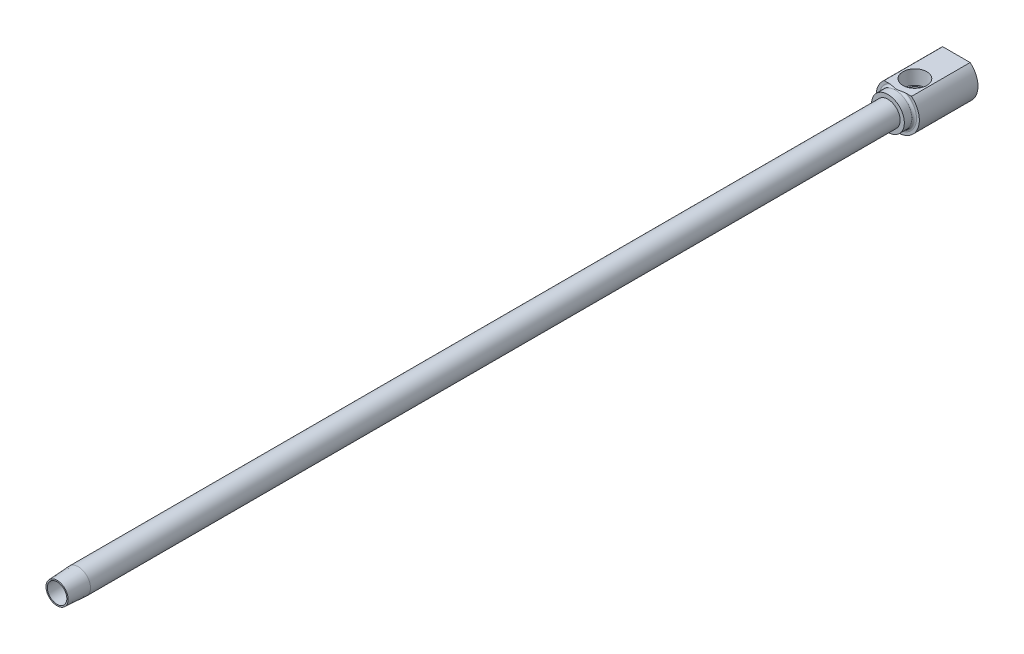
ISO-10303-21;
HEADER;
FILE_DESCRIPTION(('STEP AP214'),'2;1');
FILE_NAME('part.step','',(''),(''),'','','');
FILE_SCHEMA(('AUTOMOTIVE_DESIGN { 1 0 10303 214 1 1 1 1 }'));
ENDSEC;
DATA;
#1=APPLICATION_CONTEXT('core data for automotive mechanical design processes');
#2=APPLICATION_PROTOCOL_DEFINITION('international standard','automotive_design',2000,#1);
#3=PRODUCT_CONTEXT('',#1,'mechanical');
#4=PRODUCT('Part','Part','',(#3));
#5=PRODUCT_RELATED_PRODUCT_CATEGORY('part','',(#4));
#6=PRODUCT_DEFINITION_FORMATION('','',#4);
#7=PRODUCT_DEFINITION_CONTEXT('part definition',#1,'design');
#8=PRODUCT_DEFINITION('design','',#6,#7);
#9=PRODUCT_DEFINITION_SHAPE('','',#8);
#10=(LENGTH_UNIT() NAMED_UNIT(*) SI_UNIT(.MILLI.,.METRE.));
#11=(NAMED_UNIT(*) PLANE_ANGLE_UNIT() SI_UNIT($,.RADIAN.));
#12=(NAMED_UNIT(*) SI_UNIT($,.STERADIAN.) SOLID_ANGLE_UNIT());
#13=UNCERTAINTY_MEASURE_WITH_UNIT(LENGTH_MEASURE(1.E-05),#10,'distance_accuracy_value','');
#14=(GEOMETRIC_REPRESENTATION_CONTEXT(3) GLOBAL_UNCERTAINTY_ASSIGNED_CONTEXT((#13)) GLOBAL_UNIT_ASSIGNED_CONTEXT((#10,
#11,#12)) REPRESENTATION_CONTEXT('',''));
#15=CARTESIAN_POINT('',(0.,0.,0.));
#16=DIRECTION('',(0.,0.,1.));
#17=DIRECTION('',(1.,0.,0.));
#18=AXIS2_PLACEMENT_3D('',#15,#16,#17);
#19=CARTESIAN_POINT('',(0.,0.,-337.934766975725));
#20=DIRECTION('',(0.,0.,-1.));
#21=DIRECTION('',(-1.,0.,0.));
#22=AXIS2_PLACEMENT_3D('',#19,#20,#21);
#23=CYLINDRICAL_SURFACE('',#22,3.9751);
#24=CARTESIAN_POINT('',(0.,0.,-6.8834));
#25=DIRECTION('',(0.,0.,-1.));
#26=DIRECTION('',(-1.,0.,0.));
#27=AXIS2_PLACEMENT_3D('',#24,#25,#26);
#28=CIRCLE('',#27,3.9751);
#29=CARTESIAN_POINT('',(-3.9751,0.,-6.8834));
#30=VERTEX_POINT('',#29);
#31=EDGE_CURVE('E230',#30,#30,#28,.T.);
#32=ORIENTED_EDGE('',*,*,#31,.T.);
#33=EDGE_LOOP('',(#32));
#34=FACE_BOUND('',#33,.T.);
#35=CARTESIAN_POINT('',(0.,0.,-269.8496));
#36=DIRECTION('',(0.,0.,-1.));
#37=DIRECTION('',(-1.,0.,0.));
#38=AXIS2_PLACEMENT_3D('',#35,#36,#37);
#39=CIRCLE('',#38,3.9751);
#40=CARTESIAN_POINT('',(-3.9751,0.,-269.8496));
#41=VERTEX_POINT('',#40);
#42=EDGE_CURVE('E190',#41,#41,#39,.T.);
#43=ORIENTED_EDGE('',*,*,#42,.F.);
#44=EDGE_LOOP('',(#43));
#45=FACE_BOUND('',#44,.T.);
#46=ADVANCED_FACE('F15',(#34,#45),#23,.T.);
#47=CARTESIAN_POINT('',(-3.175,0.,-269.8496));
#48=DIRECTION('',(0.,0.,1.));
#49=DIRECTION('',(1.,0.,0.));
#50=AXIS2_PLACEMENT_3D('',#47,#48,#49);
#51=PLANE('',#50);
#52=CARTESIAN_POINT('',(0.,0.,-269.8496));
#53=DIRECTION('',(0.,0.,-1.));
#54=DIRECTION('',(-1.,0.,0.));
#55=AXIS2_PLACEMENT_3D('',#52,#53,#54);
#56=CIRCLE('',#55,3.175);
#57=CARTESIAN_POINT('',(-3.175,0.,-269.8496));
#58=VERTEX_POINT('',#57);
#59=EDGE_CURVE('E234',#58,#58,#56,.T.);
#60=ORIENTED_EDGE('',*,*,#59,.F.);
#61=EDGE_LOOP('',(#60));
#62=FACE_BOUND('',#61,.T.);
#63=CARTESIAN_POINT('',(0.,-0.206790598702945,-269.8496));
#64=DIRECTION('',(0.,0.,1.));
#65=DIRECTION('',(0.,1.,0.));
#66=AXIS2_PLACEMENT_3D('',#63,#64,#65);
#67=ELLIPSE('',#66,2.91070678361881,2.77750646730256);
#68=CARTESIAN_POINT('',(0.,2.70391618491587,-269.8496));
#69=VERTEX_POINT('',#68);
#70=EDGE_CURVE('E192',#69,#69,#67,.F.);
#71=ORIENTED_EDGE('',*,*,#70,.T.);
#72=EDGE_LOOP('',(#71));
#73=FACE_BOUND('',#72,.T.);
#74=ADVANCED_FACE('F211',(#62,#73),#51,.T.);
#75=CARTESIAN_POINT('',(-3.9751,0.,-269.8496));
#76=DIRECTION('',(0.,0.,1.));
#77=DIRECTION('',(1.,0.,0.));
#78=AXIS2_PLACEMENT_3D('',#75,#76,#77);
#79=PLANE('',#78);
#80=ORIENTED_EDGE('',*,*,#42,.T.);
#81=EDGE_LOOP('',(#80));
#82=FACE_BOUND('',#81,.T.);
#83=CARTESIAN_POINT('',(0.,0.,-269.8496));
#84=DIRECTION('',(0.,0.,-1.));
#85=DIRECTION('',(-1.,0.,0.));
#86=AXIS2_PLACEMENT_3D('',#83,#84,#85);
#87=CIRCLE('',#86,5.334);
#88=CARTESIAN_POINT('',(-5.334,0.,-269.8496));
#89=VERTEX_POINT('',#88);
#90=EDGE_CURVE('E252',#89,#89,#87,.T.);
#91=ORIENTED_EDGE('',*,*,#90,.F.);
#92=EDGE_LOOP('',(#91));
#93=FACE_BOUND('',#92,.T.);
#94=ADVANCED_FACE('F214',(#82,#93),#79,.T.);
#95=CARTESIAN_POINT('',(-3.175,0.,0.));
#96=DIRECTION('',(0.,0.,1.));
#97=DIRECTION('',(1.,0.,0.));
#98=AXIS2_PLACEMENT_3D('',#95,#96,#97);
#99=PLANE('',#98);
#100=CARTESIAN_POINT('',(0.,0.,0.));
#101=DIRECTION('',(0.,0.,-1.));
#102=DIRECTION('',(-1.,0.,0.));
#103=AXIS2_PLACEMENT_3D('',#100,#101,#102);
#104=CIRCLE('',#103,3.5941);
#105=CARTESIAN_POINT('',(-3.5941,0.,0.));
#106=VERTEX_POINT('',#105);
#107=EDGE_CURVE('E508',#106,#106,#104,.T.);
#108=ORIENTED_EDGE('',*,*,#107,.F.);
#109=EDGE_LOOP('',(#108));
#110=FACE_BOUND('',#109,.T.);
#111=CARTESIAN_POINT('',(0.,0.,0.));
#112=DIRECTION('',(0.,0.,-1.));
#113=DIRECTION('',(-1.,0.,0.));
#114=AXIS2_PLACEMENT_3D('',#111,#112,#113);
#115=CIRCLE('',#114,3.175);
#116=CARTESIAN_POINT('',(-3.175,0.,0.));
#117=VERTEX_POINT('',#116);
#118=EDGE_CURVE('E19',#117,#117,#115,.T.);
#119=ORIENTED_EDGE('',*,*,#118,.T.);
#120=EDGE_LOOP('',(#119));
#121=FACE_BOUND('',#120,.T.);
#122=ADVANCED_FACE('F17',(#110,#121),#99,.T.);
#123=CARTESIAN_POINT('',(0.,0.,-337.934766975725));
#124=DIRECTION('',(0.,0.,-1.));
#125=DIRECTION('',(-1.,0.,0.));
#126=AXIS2_PLACEMENT_3D('',#123,#124,#125);
#127=CYLINDRICAL_SURFACE('',#126,3.175);
#128=ORIENTED_EDGE('',*,*,#59,.T.);
#129=EDGE_LOOP('',(#128));
#130=FACE_BOUND('',#129,.T.);
#131=ORIENTED_EDGE('',*,*,#118,.F.);
#132=EDGE_LOOP('',(#131));
#133=FACE_BOUND('',#132,.T.);
#134=ADVANCED_FACE('F209',(#130,#133),#127,.F.);
#135=CARTESIAN_POINT('',(-7.0104,0.,-292.1));
#136=DIRECTION('',(0.,0.,-1.));
#137=DIRECTION('',(-1.,0.,0.));
#138=AXIS2_PLACEMENT_3D('',#135,#136,#137);
#139=PLANE('',#138);
#140=DIRECTION('',(1.,0.,0.));
#141=VECTOR('',#140,1.);
#142=CARTESIAN_POINT('',(-1.83308710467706,3.175,-292.1));
#143=LINE('',#142,#141);
#144=CARTESIAN_POINT('',(-1.83308710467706,3.175,-292.1));
#145=VERTEX_POINT('',#144);
#146=CARTESIAN_POINT('',(1.83308710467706,3.175,-292.1));
#147=VERTEX_POINT('',#146);
#148=EDGE_CURVE('E37',#145,#147,#143,.T.);
#149=ORIENTED_EDGE('',*,*,#148,.F.);
#150=DIRECTION('',(0.5,0.866025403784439,0.));
#151=VECTOR('',#150,1.);
#152=CARTESIAN_POINT('',(-3.66617420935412,0.,-292.1));
#153=LINE('',#152,#151);
#154=CARTESIAN_POINT('',(-3.66617420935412,0.,-292.1));
#155=VERTEX_POINT('',#154);
#156=EDGE_CURVE('E278',#155,#145,#153,.T.);
#157=ORIENTED_EDGE('',*,*,#156,.F.);
#158=DIRECTION('',(-0.5,0.866025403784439,0.));
#159=VECTOR('',#158,1.);
#160=CARTESIAN_POINT('',(-1.83308710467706,-3.175,-292.1));
#161=LINE('',#160,#159);
#162=CARTESIAN_POINT('',(-1.83308710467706,-3.175,-292.1));
#163=VERTEX_POINT('',#162);
#164=EDGE_CURVE('E282',#163,#155,#161,.T.);
#165=ORIENTED_EDGE('',*,*,#164,.F.);
#166=DIRECTION('',(-1.,0.,0.));
#167=VECTOR('',#166,1.);
#168=CARTESIAN_POINT('',(1.83308710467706,-3.175,-292.1));
#169=LINE('',#168,#167);
#170=CARTESIAN_POINT('',(1.83308710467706,-3.175,-292.1));
#171=VERTEX_POINT('',#170);
#172=EDGE_CURVE('E285',#171,#163,#169,.T.);
#173=ORIENTED_EDGE('',*,*,#172,.F.);
#174=DIRECTION('',(-0.5,-0.866025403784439,0.));
#175=VECTOR('',#174,1.);
#176=CARTESIAN_POINT('',(3.66617420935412,0.,-292.1));
#177=LINE('',#176,#175);
#178=CARTESIAN_POINT('',(3.66617420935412,0.,-292.1));
#179=VERTEX_POINT('',#178);
#180=EDGE_CURVE('E288',#179,#171,#177,.T.);
#181=ORIENTED_EDGE('',*,*,#180,.F.);
#182=DIRECTION('',(0.5,-0.866025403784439,0.));
#183=VECTOR('',#182,1.);
#184=CARTESIAN_POINT('',(1.83308710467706,3.175,-292.1));
#185=LINE('',#184,#183);
#186=EDGE_CURVE('E291',#147,#179,#185,.T.);
#187=ORIENTED_EDGE('',*,*,#186,.F.);
#188=EDGE_LOOP('',(#149,#157,#165,#173,#181,#187));
#189=FACE_BOUND('',#188,.T.);
#190=DIRECTION('',(-1.,0.,0.));
#191=VECTOR('',#190,1.);
#192=CARTESIAN_POINT('',(-4.4577,5.41060244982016,-292.1));
#193=LINE('',#192,#191);
#194=CARTESIAN_POINT('',(4.4577,5.41060244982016,-292.1));
#195=VERTEX_POINT('',#194);
#196=CARTESIAN_POINT('',(-4.4577,5.41060244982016,-292.1));
#197=VERTEX_POINT('',#196);
#198=EDGE_CURVE('E261',#195,#197,#193,.T.);
#199=ORIENTED_EDGE('',*,*,#198,.F.);
#200=CARTESIAN_POINT('',(0.,0.,-292.1));
#201=DIRECTION('',(0.,0.,-1.));
#202=DIRECTION('',(-1.,0.,0.));
#203=AXIS2_PLACEMENT_3D('',#200,#201,#202);
#204=CIRCLE('',#203,7.0104);
#205=EDGE_CURVE('E238',#195,#197,#204,.T.);
#206=ORIENTED_EDGE('',*,*,#205,.T.);
#207=EDGE_LOOP('',(#199,#206));
#208=FACE_BOUND('',#207,.T.);
#209=ADVANCED_FACE('F205',(#189,#208),#139,.T.);
#210=CARTESIAN_POINT('',(0.,0.,-337.934766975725));
#211=DIRECTION('',(0.,0.,-1.));
#212=DIRECTION('',(-1.,0.,0.));
#213=AXIS2_PLACEMENT_3D('',#210,#211,#212);
#214=CYLINDRICAL_SURFACE('',#213,7.0104);
#215=DIRECTION('',(0.,0.,-1.));
#216=VECTOR('',#215,1.);
#217=CARTESIAN_POINT('',(-4.4577,5.41060244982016,-262.7376));
#218=LINE('',#217,#216);
#219=CARTESIAN_POINT('',(-4.4577,5.41060244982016,-273.05));
#220=VERTEX_POINT('',#219);
#221=EDGE_CURVE('E258',#220,#197,#218,.T.);
#222=ORIENTED_EDGE('',*,*,#221,.T.);
#223=ORIENTED_EDGE('',*,*,#205,.F.);
#224=DIRECTION('',(0.,0.,-1.));
#225=VECTOR('',#224,1.);
#226=CARTESIAN_POINT('',(4.4577,5.41060244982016,-262.7376));
#227=LINE('',#226,#225);
#228=CARTESIAN_POINT('',(4.4577,5.41060244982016,-273.05));
#229=VERTEX_POINT('',#228);
#230=EDGE_CURVE('E259',#229,#195,#227,.T.);
#231=ORIENTED_EDGE('',*,*,#230,.F.);
#232=CARTESIAN_POINT('',(0.,0.,-273.05));
#233=DIRECTION('',(0.,0.,-1.));
#234=DIRECTION('',(-1.,0.,0.));
#235=AXIS2_PLACEMENT_3D('',#232,#233,#234);
#236=CIRCLE('',#235,7.0104);
#237=EDGE_CURVE('E241',#229,#220,#236,.T.);
#238=ORIENTED_EDGE('',*,*,#237,.T.);
#239=EDGE_LOOP('',(#222,#223,#231,#238));
#240=FACE_BOUND('',#239,.T.);
#241=ADVANCED_FACE('F201',(#240),#214,.T.);
#242=CARTESIAN_POINT('',(-6.096,0.,-273.05));
#243=DIRECTION('',(0.,0.,1.));
#244=DIRECTION('',(1.,0.,0.));
#245=AXIS2_PLACEMENT_3D('',#242,#243,#244);
#246=PLANE('',#245);
#247=DIRECTION('',(1.,0.,0.));
#248=VECTOR('',#247,1.);
#249=CARTESIAN_POINT('',(-6.096,5.41060244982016,-273.05));
#250=LINE('',#249,#248);
#251=CARTESIAN_POINT('',(-2.80830858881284,5.41060244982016,-273.05));
#252=VERTEX_POINT('',#251);
#253=EDGE_CURVE('E255',#220,#252,#250,.T.);
#254=ORIENTED_EDGE('',*,*,#253,.F.);
#255=ORIENTED_EDGE('',*,*,#237,.F.);
#256=CARTESIAN_POINT('',(2.80830858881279,5.41060244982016,-273.05));
#257=VERTEX_POINT('',#256);
#258=EDGE_CURVE('E256',#257,#229,#250,.T.);
#259=ORIENTED_EDGE('',*,*,#258,.F.);
#260=CARTESIAN_POINT('',(0.,0.,-273.05));
#261=DIRECTION('',(0.,0.,-1.));
#262=DIRECTION('',(-1.,0.,0.));
#263=AXIS2_PLACEMENT_3D('',#260,#261,#262);
#264=CIRCLE('',#263,6.096);
#265=EDGE_CURVE('E246',#257,#252,#264,.T.);
#266=ORIENTED_EDGE('',*,*,#265,.T.);
#267=EDGE_LOOP('',(#254,#255,#259,#266));
#268=FACE_BOUND('',#267,.T.);
#269=ADVANCED_FACE('F197',(#268),#246,.T.);
#270=CARTESIAN_POINT('',(0.,0.,-272.288));
#271=DIRECTION('',(0.,0.,-1.));
#272=DIRECTION('',(-1.,0.,0.));
#273=AXIS2_PLACEMENT_3D('',#270,#271,#272);
#274=TOROIDAL_SURFACE('',#273,6.096,0.762);
#275=CARTESIAN_POINT('',(0.,5.41060244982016,-272.620977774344));
#276=CARTESIAN_POINT('',(0.0521470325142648,5.41060244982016,-272.620966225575));
#277=CARTESIAN_POINT('',(0.104287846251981,5.41060244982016,-272.622542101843));
#278=CARTESIAN_POINT('',(0.208401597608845,5.41060244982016,-272.628631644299));
#279=CARTESIAN_POINT('',(0.26037450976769,5.41060244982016,-272.633145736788));
#280=CARTESIAN_POINT('',(0.41624150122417,5.41060244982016,-272.650448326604));
#281=CARTESIAN_POINT('',(0.519704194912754,5.41060244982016,-272.666991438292));
#282=CARTESIAN_POINT('',(0.7269184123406,5.41060244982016,-272.705619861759));
#283=CARTESIAN_POINT('',(0.830655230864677,5.41060244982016,-272.727776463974));
#284=CARTESIAN_POINT('',(1.03759009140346,5.41060244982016,-272.773840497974));
#285=CARTESIAN_POINT('',(1.14078865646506,5.41060244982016,-272.797745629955));
#286=CARTESIAN_POINT('',(1.34834228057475,5.41060244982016,-272.845205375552));
#287=CARTESIAN_POINT('',(1.45269869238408,5.41060244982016,-272.868754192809));
#288=CARTESIAN_POINT('',(1.66197970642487,5.41060244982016,-272.913460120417));
#289=CARTESIAN_POINT('',(1.76690452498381,5.41060244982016,-272.934616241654));
#290=CARTESIAN_POINT('',(1.97693672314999,5.41060244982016,-272.972852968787));
#291=CARTESIAN_POINT('',(2.08204009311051,5.41060244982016,-272.989954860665));
#292=CARTESIAN_POINT('',(2.29298648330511,5.41060244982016,-273.018645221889));
#293=CARTESIAN_POINT('',(2.39882937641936,5.41060244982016,-273.030234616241));
#294=CARTESIAN_POINT('',(2.63825679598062,5.41060244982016,-273.048170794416));
#295=CARTESIAN_POINT('',(2.77203238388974,5.41060244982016,-273.052426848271));
#296=CARTESIAN_POINT('',(2.97236053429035,5.41060244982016,-273.04675427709));
#297=CARTESIAN_POINT('',(3.03908464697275,5.41060244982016,-273.04285339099));
#298=CARTESIAN_POINT('',(3.17206397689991,5.41060244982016,-273.030250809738));
#299=CARTESIAN_POINT('',(3.23831943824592,5.41060244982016,-273.021551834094));
#300=CARTESIAN_POINT('',(3.37725624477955,5.41060244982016,-272.99711512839));
#301=CARTESIAN_POINT('',(3.44982215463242,5.41060244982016,-272.98069575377));
#302=CARTESIAN_POINT('',(3.59245961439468,5.41060244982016,-272.939071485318));
#303=CARTESIAN_POINT('',(3.66253326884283,5.41060244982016,-272.913874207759));
#304=CARTESIAN_POINT('',(3.77900159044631,5.41060244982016,-272.861023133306));
#305=CARTESIAN_POINT('',(3.82657256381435,5.41060244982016,-272.835989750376));
#306=CARTESIAN_POINT('',(3.91754959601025,5.41060244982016,-272.779184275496));
#307=CARTESIAN_POINT('',(3.96096325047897,5.41060244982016,-272.747424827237));
#308=CARTESIAN_POINT('',(4.02798010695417,5.41060244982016,-272.68789070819));
#309=CARTESIAN_POINT('',(4.05342428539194,5.41060244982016,-272.662198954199));
#310=CARTESIAN_POINT('',(4.10009948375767,5.41060244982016,-272.607215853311));
#311=CARTESIAN_POINT('',(4.12133630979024,5.41060244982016,-272.577929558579));
#312=CARTESIAN_POINT('',(4.15466127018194,5.41060244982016,-272.52188761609));
#313=CARTESIAN_POINT('',(4.1677217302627,5.41060244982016,-272.495714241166));
#314=CARTESIAN_POINT('',(4.18933719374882,5.41060244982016,-272.441556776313));
#315=CARTESIAN_POINT('',(4.19789541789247,5.41060244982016,-272.413573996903));
#316=CARTESIAN_POINT('',(4.20987180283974,5.41060244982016,-272.356334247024));
#317=CARTESIAN_POINT('',(4.21325884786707,5.41060244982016,-272.327070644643));
#318=CARTESIAN_POINT('',(4.21447858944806,5.41060244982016,-272.268428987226));
#319=CARTESIAN_POINT('',(4.2123124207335,5.41060244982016,-272.239050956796));
#320=CARTESIAN_POINT('',(4.20309810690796,5.41060244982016,-272.183964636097));
#321=CARTESIAN_POINT('',(4.19653350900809,5.41060244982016,-272.158172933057));
#322=CARTESIAN_POINT('',(4.17948851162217,5.41060244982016,-272.107930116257));
#323=CARTESIAN_POINT('',(4.16900680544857,5.41060244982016,-272.083479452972));
#324=CARTESIAN_POINT('',(4.14035818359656,5.41060244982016,-272.027852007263));
#325=CARTESIAN_POINT('',(4.12078333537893,5.41060244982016,-271.99740126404));
#326=CARTESIAN_POINT('',(4.07697861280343,5.41060244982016,-271.940060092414));
#327=CARTESIAN_POINT('',(4.05273917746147,5.41060244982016,-271.913177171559));
#328=CARTESIAN_POINT('',(3.9886872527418,5.41060244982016,-271.851156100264));
#329=CARTESIAN_POINT('',(3.94690497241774,5.41060244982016,-271.818064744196));
#330=CARTESIAN_POINT('',(3.85879527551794,5.41060244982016,-271.758693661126));
#331=CARTESIAN_POINT('',(3.81245915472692,5.41060244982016,-271.732427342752));
#332=CARTESIAN_POINT('',(3.72452671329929,5.41060244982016,-271.689445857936));
#333=CARTESIAN_POINT('',(3.68333828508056,5.41060244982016,-271.671877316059));
#334=CARTESIAN_POINT('',(3.59958587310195,5.41060244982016,-271.640360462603));
#335=CARTESIAN_POINT('',(3.55702092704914,5.41060244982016,-271.626414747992));
#336=CARTESIAN_POINT('',(3.42786902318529,5.41060244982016,-271.589290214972));
#337=CARTESIAN_POINT('',(3.339912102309,5.41060244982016,-271.570863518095));
#338=CARTESIAN_POINT('',(3.16528158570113,5.41060244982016,-271.544240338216));
#339=CARTESIAN_POINT('',(3.07864723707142,5.41060244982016,-271.535756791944));
#340=CARTESIAN_POINT('',(2.90489485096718,5.41060244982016,-271.526131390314));
#341=CARTESIAN_POINT('',(2.8177763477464,5.41060244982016,-271.524998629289));
#342=CARTESIAN_POINT('',(2.64327811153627,5.41060244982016,-271.52865046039));
#343=CARTESIAN_POINT('',(2.55589913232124,5.41060244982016,-271.533463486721));
#344=CARTESIAN_POINT('',(2.38166962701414,5.41060244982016,-271.547864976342));
#345=CARTESIAN_POINT('',(2.29481855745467,5.41060244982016,-271.557447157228));
#346=CARTESIAN_POINT('',(2.01384766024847,5.41060244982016,-271.594670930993));
#347=CARTESIAN_POINT('',(1.82076533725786,5.41060244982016,-271.629945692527));
#348=CARTESIAN_POINT('',(1.53229430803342,5.41060244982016,-271.689884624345));
#349=CARTESIAN_POINT('',(1.43609183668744,5.41060244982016,-271.711096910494));
#350=CARTESIAN_POINT('',(1.24390982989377,5.41060244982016,-271.754534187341));
#351=CARTESIAN_POINT('',(1.14793028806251,5.41060244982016,-271.776759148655));
#352=CARTESIAN_POINT('',(0.957697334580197,5.41060244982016,-271.820093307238));
#353=CARTESIAN_POINT('',(0.863446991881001,5.41060244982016,-271.841215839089));
#354=CARTESIAN_POINT('',(0.674290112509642,5.41060244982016,-271.880544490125));
#355=CARTESIAN_POINT('',(0.57938341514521,5.41060244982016,-271.898749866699));
#356=CARTESIAN_POINT('',(0.389272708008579,5.41060244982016,-271.928753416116));
#357=CARTESIAN_POINT('',(0.294077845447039,5.41060244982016,-271.940603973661));
#358=CARTESIAN_POINT('',(0.15079180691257,5.41060244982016,-271.951139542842));
#359=CARTESIAN_POINT('',(0.102969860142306,5.41060244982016,-271.953445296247));
#360=CARTESIAN_POINT('',(0.00727423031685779,5.41060244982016,-271.9554444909));
#361=CARTESIAN_POINT('',(-0.0405994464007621,5.41060244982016,-271.955138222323));
#362=CARTESIAN_POINT('',(-0.13693423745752,5.41060244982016,-271.951917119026));
#363=CARTESIAN_POINT('',(-0.185394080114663,5.41060244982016,-271.948965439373));
#364=CARTESIAN_POINT('',(-0.282118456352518,5.41060244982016,-271.940689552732));
#365=CARTESIAN_POINT('',(-0.330382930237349,5.41060244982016,-271.935364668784));
#366=CARTESIAN_POINT('',(-0.475151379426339,5.41060244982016,-271.916449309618));
#367=CARTESIAN_POINT('',(-0.571263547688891,5.41060244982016,-271.899936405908));
#368=CARTESIAN_POINT('',(-0.76404790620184,5.41060244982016,-271.862565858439));
#369=CARTESIAN_POINT('',(-0.860707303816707,5.41060244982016,-271.841647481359));
#370=CARTESIAN_POINT('',(-1.05357295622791,5.41060244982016,-271.798459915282));
#371=CARTESIAN_POINT('',(-1.1497796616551,5.41060244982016,-271.776192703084));
#372=CARTESIAN_POINT('',(-1.36433899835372,5.41060244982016,-271.727144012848));
#373=CARTESIAN_POINT('',(-1.48272280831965,5.41060244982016,-271.700495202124));
#374=CARTESIAN_POINT('',(-1.72029970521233,5.41060244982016,-271.650573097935));
#375=CARTESIAN_POINT('',(-1.83949323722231,5.41060244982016,-271.627301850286));
#376=CARTESIAN_POINT('',(-2.07789765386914,5.41060244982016,-271.586591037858));
#377=CARTESIAN_POINT('',(-2.19710038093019,5.41060244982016,-271.569105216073));
#378=CARTESIAN_POINT('',(-2.43636519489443,5.41060244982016,-271.542063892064));
#379=CARTESIAN_POINT('',(-2.5564264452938,5.41060244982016,-271.532501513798));
#380=CARTESIAN_POINT('',(-2.76780194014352,5.41060244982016,-271.52516409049));
#381=CARTESIAN_POINT('',(-2.85902659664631,5.41060244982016,-271.525092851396));
#382=CARTESIAN_POINT('',(-3.04144991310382,5.41060244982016,-271.532751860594));
#383=CARTESIAN_POINT('',(-3.13264774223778,5.41060244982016,-271.540504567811));
#384=CARTESIAN_POINT('',(-3.31458996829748,5.41060244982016,-271.566086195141));
#385=CARTESIAN_POINT('',(-3.40532344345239,5.41060244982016,-271.584002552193));
#386=CARTESIAN_POINT('',(-3.53857286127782,5.41060244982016,-271.620698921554));
#387=CARTESIAN_POINT('',(-3.58245316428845,5.41060244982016,-271.634541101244));
#388=CARTESIAN_POINT('',(-3.66883050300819,5.41060244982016,-271.665985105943));
#389=CARTESIAN_POINT('',(-3.71132868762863,5.41060244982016,-271.683583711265));
#390=CARTESIAN_POINT('',(-3.79234387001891,5.41060244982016,-271.722178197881));
#391=CARTESIAN_POINT('',(-3.83095410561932,5.41060244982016,-271.742975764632));
#392=CARTESIAN_POINT('',(-3.90549335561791,5.41060244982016,-271.789081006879));
#393=CARTESIAN_POINT('',(-3.94141935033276,5.41060244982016,-271.814393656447));
#394=CARTESIAN_POINT('',(-4.00964525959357,5.41060244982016,-271.870392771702));
#395=CARTESIAN_POINT('',(-4.04189445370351,5.41060244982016,-271.901142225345));
#396=CARTESIAN_POINT('',(-4.10014383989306,5.41060244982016,-271.968084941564));
#397=CARTESIAN_POINT('',(-4.12616464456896,5.41060244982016,-272.004259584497));
#398=CARTESIAN_POINT('',(-4.16162371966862,5.41060244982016,-272.067760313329));
#399=CARTESIAN_POINT('',(-4.17366550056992,5.41060244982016,-272.093633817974));
#400=CARTESIAN_POINT('',(-4.19334521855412,5.41060244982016,-272.147014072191));
#401=CARTESIAN_POINT('',(-4.20098675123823,5.41060244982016,-272.174519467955));
#402=CARTESIAN_POINT('',(-4.21130602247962,5.41060244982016,-272.23060948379));
#403=CARTESIAN_POINT('',(-4.21395773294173,5.41060244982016,-272.259198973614));
#404=CARTESIAN_POINT('',(-4.21398264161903,5.41060244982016,-272.316380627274));
#405=CARTESIAN_POINT('',(-4.21135613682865,5.41060244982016,-272.34497279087));
#406=CARTESIAN_POINT('',(-4.2014381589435,5.41060244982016,-272.399159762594));
#407=CARTESIAN_POINT('',(-4.19450087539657,5.41060244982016,-272.424821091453));
#408=CARTESIAN_POINT('',(-4.17676949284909,5.41060244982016,-272.474761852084));
#409=CARTESIAN_POINT('',(-4.16597399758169,5.41060244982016,-272.499040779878));
#410=CARTESIAN_POINT('',(-4.13643456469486,5.41060244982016,-272.554664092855));
#411=CARTESIAN_POINT('',(-4.11622825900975,5.41060244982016,-272.58523117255));
#412=CARTESIAN_POINT('',(-4.07115731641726,5.41060244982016,-272.642709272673));
#413=CARTESIAN_POINT('',(-4.04628281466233,5.41060244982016,-272.669612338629));
#414=CARTESIAN_POINT('',(-3.98047143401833,5.41060244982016,-272.731796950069));
#415=CARTESIAN_POINT('',(-3.93753463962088,5.41060244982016,-272.764948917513));
#416=CARTESIAN_POINT('',(-3.84713170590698,5.41060244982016,-272.824276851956));
#417=CARTESIAN_POINT('',(-3.79965701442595,5.41060244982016,-272.850439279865));
#418=CARTESIAN_POINT('',(-3.70945527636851,5.41060244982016,-272.893219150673));
#419=CARTESIAN_POINT('',(-3.66712202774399,5.41060244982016,-272.910685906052));
#420=CARTESIAN_POINT('',(-3.5810935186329,5.41060244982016,-272.941903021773));
#421=CARTESIAN_POINT('',(-3.53739729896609,5.41060244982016,-272.955650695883));
#422=CARTESIAN_POINT('',(-3.40486938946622,5.41060244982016,-272.992069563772));
#423=CARTESIAN_POINT('',(-3.3146965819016,5.41060244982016,-273.009873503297));
#424=CARTESIAN_POINT('',(-3.13512177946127,5.41060244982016,-273.035172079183));
#425=CARTESIAN_POINT('',(-3.04574747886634,5.41060244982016,-273.042887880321));
#426=CARTESIAN_POINT('',(-2.86659161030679,5.41060244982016,-273.050757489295));
#427=CARTESIAN_POINT('',(-2.77680968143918,5.41060244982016,-273.050902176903));
#428=CARTESIAN_POINT('',(-2.5970702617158,5.41060244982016,-273.045129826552));
#429=CARTESIAN_POINT('',(-2.50711380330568,5.41060244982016,-273.039185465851));
#430=CARTESIAN_POINT('',(-2.32777785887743,5.41060244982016,-273.022449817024));
#431=CARTESIAN_POINT('',(-2.2383978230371,5.41060244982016,-273.011664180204));
#432=CARTESIAN_POINT('',(-1.96748151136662,5.41060244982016,-272.97309869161));
#433=CARTESIAN_POINT('',(-1.78682109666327,5.41060244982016,-272.93931320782));
#434=CARTESIAN_POINT('',(-1.51682052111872,5.41060244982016,-272.88271359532));
#435=CARTESIAN_POINT('',(-1.42679945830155,5.41060244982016,-272.86281263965));
#436=CARTESIAN_POINT('',(-1.24695389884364,5.41060244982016,-272.822143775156));
#437=CARTESIAN_POINT('',(-1.15712938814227,5.41060244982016,-272.801375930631));
#438=CARTESIAN_POINT('',(-0.979057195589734,5.41060244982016,-272.760739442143));
#439=CARTESIAN_POINT('',(-0.890811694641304,5.41060244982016,-272.740861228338));
#440=CARTESIAN_POINT('',(-0.713780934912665,5.41060244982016,-272.703401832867));
#441=CARTESIAN_POINT('',(-0.624995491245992,5.41060244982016,-272.685821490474));
#442=CARTESIAN_POINT('',(-0.447203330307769,5.41060244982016,-272.655660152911));
#443=CARTESIAN_POINT('',(-0.358203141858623,5.41060244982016,-272.643043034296));
#444=CARTESIAN_POINT('',(-0.179461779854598,5.41060244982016,-272.625716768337));
#445=CARTESIAN_POINT('',(-0.0897216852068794,5.41060244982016,-272.620997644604));
#446=CARTESIAN_POINT('',(0.,5.41060244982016,-272.620977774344));
#447=B_SPLINE_CURVE_WITH_KNOTS('',3,(#275,#276,#277,#278,#279,#280,#281,#282,#283,#284,#285,
#286,#287,#288,#289,#290,#291,#292,#293,#294,#295,#296,#297,#298,#299,#300,#301,#302,#303,#304,
#305,#306,#307,#308,#309,#310,#311,#312,#313,#314,#315,#316,#317,#318,#319,#320,#321,#322,#323,
#324,#325,#326,#327,#328,#329,#330,#331,#332,#333,#334,#335,#336,#337,#338,#339,#340,#341,#342,
#343,#344,#345,#346,#347,#348,#349,#350,#351,#352,#353,#354,#355,#356,#357,#358,#359,#360,#361,
#362,#363,#364,#365,#366,#367,#368,#369,#370,#371,#372,#373,#374,#375,#376,#377,#378,#379,#380,
#381,#382,#383,#384,#385,#386,#387,#388,#389,#390,#391,#392,#393,#394,#395,#396,#397,#398,#399,
#400,#401,#402,#403,#404,#405,#406,#407,#408,#409,#410,#411,#412,#413,#414,#415,#416,#417,#418,
#419,#420,#421,#422,#423,#424,#425,#426,#427,#428,#429,#430,#431,#432,#433,#434,#435,#436,#437,
#438,#439,#440,#441,#442,#443,#444,#445,#446),.UNSPECIFIED.,.T.,.F.,(4,2,2,2,2,2,2,2,2,2,2,2,2,
2,2,2,2,2,2,2,2,2,2,2,2,2,2,2,2,2,2,2,2,2,2,2,2,2,2,2,2,2,2,2,2,2,2,2,2,2,2,2,2,2,2,2,2,2,2,2,2,
2,2,2,2,2,2,2,2,2,2,2,2,2,2,2,2,2,2,2,2,2,2,2,2,4),(0.,0.156408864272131,0.312840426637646,
0.626836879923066,0.945040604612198,1.26283307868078,1.58376524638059,1.90482960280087,
2.22416896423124,2.54345472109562,2.9441659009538,3.14454518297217,3.3448110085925,
3.56760205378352,3.79020027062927,3.95104939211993,4.11159879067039,4.21974493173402,
4.32774077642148,4.41514397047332,4.50248455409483,4.59034863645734,4.67819476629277,
4.75769203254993,4.83721584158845,4.94521135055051,5.05343062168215,5.2124385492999,
5.37175654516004,5.50590155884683,5.64014246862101,5.90890810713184,6.16970670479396,
6.43082789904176,6.69320268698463,6.95523275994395,7.5434079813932,7.83896772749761,
8.13451890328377,8.42427298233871,8.71410070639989,9.00150106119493,9.14506775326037,
9.28861849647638,9.43420020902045,9.5798234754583,9.87216797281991,10.1688428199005,
10.4650929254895,10.8291174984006,11.193361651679,11.5546188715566,11.9155622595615,
12.1889721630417,12.4631691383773,12.7397615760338,12.8776619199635,13.0154445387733,
13.1467577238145,13.2782164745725,13.411312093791,13.5439609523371,13.6292456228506,
13.7144605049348,13.8001186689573,13.8857720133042,13.965178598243,14.0446139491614,
14.1539273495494,14.2634744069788,14.4253063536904,14.5874495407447,14.7246386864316,
14.8619266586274,15.1368206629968,15.4055810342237,15.6746651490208,15.9449620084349,
16.2149441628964,16.7658370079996,17.0424344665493,17.319011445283,17.5903768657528,
17.8618411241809,18.131291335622,18.4004009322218),.UNSPECIFIED.);
#448=EDGE_CURVE('E105',#252,#257,#447,.T.);
#449=ORIENTED_EDGE('',*,*,#448,.F.);
#450=ORIENTED_EDGE('',*,*,#265,.F.);
#451=EDGE_LOOP('',(#449,#450));
#452=FACE_BOUND('',#451,.T.);
#453=CARTESIAN_POINT('',(0.,0.,-272.288));
#454=DIRECTION('',(0.,0.,-1.));
#455=DIRECTION('',(-1.,0.,0.));
#456=AXIS2_PLACEMENT_3D('',#453,#454,#455);
#457=CIRCLE('',#456,5.334);
#458=CARTESIAN_POINT('',(-5.334,0.,-272.288));
#459=VERTEX_POINT('',#458);
#460=EDGE_CURVE('E249',#459,#459,#457,.T.);
#461=ORIENTED_EDGE('',*,*,#460,.T.);
#462=EDGE_LOOP('',(#461));
#463=FACE_BOUND('',#462,.T.);
#464=ADVANCED_FACE('F193',(#452,#463),#274,.F.);
#465=CARTESIAN_POINT('',(0.,0.,-337.934766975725));
#466=DIRECTION('',(0.,0.,-1.));
#467=DIRECTION('',(-1.,0.,0.));
#468=AXIS2_PLACEMENT_3D('',#465,#466,#467);
#469=CYLINDRICAL_SURFACE('',#468,5.334);
#470=ORIENTED_EDGE('',*,*,#90,.T.);
#471=EDGE_LOOP('',(#470));
#472=FACE_BOUND('',#471,.T.);
#473=ORIENTED_EDGE('',*,*,#460,.F.);
#474=EDGE_LOOP('',(#473));
#475=FACE_BOUND('',#474,.T.);
#476=ADVANCED_FACE('F183',(#472,#475),#469,.T.);
#477=CARTESIAN_POINT('',(-4.4577,5.41060244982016,-262.7376));
#478=DIRECTION('',(0.,-1.,0.));
#479=DIRECTION('',(0.,0.,-1.));
#480=AXIS2_PLACEMENT_3D('',#477,#478,#479);
#481=PLANE('',#480);
#482=CARTESIAN_POINT('',(0.,5.41060244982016,-278.6126));
#483=DIRECTION('',(0.,-1.,0.));
#484=DIRECTION('',(0.,0.,-1.));
#485=AXIS2_PLACEMENT_3D('',#482,#483,#484);
#486=CIRCLE('',#485,3.8800785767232);
#487=CARTESIAN_POINT('',(0.,5.41060244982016,-282.492678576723));
#488=VERTEX_POINT('',#487);
#489=EDGE_CURVE('E510',#488,#488,#486,.T.);
#490=ORIENTED_EDGE('',*,*,#489,.T.);
#491=EDGE_LOOP('',(#490));
#492=FACE_BOUND('',#491,.T.);
#493=ORIENTED_EDGE('',*,*,#253,.T.);
#494=ORIENTED_EDGE('',*,*,#448,.T.);
#495=ORIENTED_EDGE('',*,*,#258,.T.);
#496=ORIENTED_EDGE('',*,*,#230,.T.);
#497=ORIENTED_EDGE('',*,*,#198,.T.);
#498=ORIENTED_EDGE('',*,*,#221,.F.);
#499=EDGE_LOOP('',(#493,#494,#495,#496,#497,#498));
#500=FACE_BOUND('',#499,.T.);
#501=ADVANCED_FACE('F179',(#492,#500),#481,.F.);
#502=CARTESIAN_POINT('',(-1.83308710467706,3.175,-287.274));
#503=DIRECTION('',(0.,1.,0.));
#504=DIRECTION('',(-1.,0.,0.));
#505=AXIS2_PLACEMENT_3D('',#502,#503,#504);
#506=PLANE('',#505);
#507=ORIENTED_EDGE('',*,*,#148,.T.);
#508=DIRECTION('',(0.,0.,-1.));
#509=VECTOR('',#508,1.);
#510=CARTESIAN_POINT('',(1.83308710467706,3.175,-287.274));
#511=LINE('',#510,#509);
#512=CARTESIAN_POINT('',(1.83308710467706,3.175,-287.274));
#513=VERTEX_POINT('',#512);
#514=EDGE_CURVE('E266',#513,#147,#511,.T.);
#515=ORIENTED_EDGE('',*,*,#514,.F.);
#516=DIRECTION('',(1.,0.,0.));
#517=VECTOR('',#516,1.);
#518=CARTESIAN_POINT('',(-1.83308710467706,3.175,-287.274));
#519=LINE('',#518,#517);
#520=CARTESIAN_POINT('',(-1.83308710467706,3.175,-287.274));
#521=VERTEX_POINT('',#520);
#522=EDGE_CURVE('E281',#521,#513,#519,.T.);
#523=ORIENTED_EDGE('',*,*,#522,.F.);
#524=DIRECTION('',(0.,0.,-1.));
#525=VECTOR('',#524,1.);
#526=CARTESIAN_POINT('',(-1.83308710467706,3.175,-287.274));
#527=LINE('',#526,#525);
#528=EDGE_CURVE('E265',#521,#145,#527,.T.);
#529=ORIENTED_EDGE('',*,*,#528,.T.);
#530=EDGE_LOOP('',(#507,#515,#523,#529));
#531=FACE_BOUND('',#530,.T.);
#532=ADVANCED_FACE('F161',(#531),#506,.F.);
#533=CARTESIAN_POINT('',(-3.66617420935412,0.,-287.274));
#534=DIRECTION('',(-0.866025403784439,0.5,0.));
#535=DIRECTION('',(-0.5,-0.866025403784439,0.));
#536=AXIS2_PLACEMENT_3D('',#533,#534,#535);
#537=PLANE('',#536);
#538=ORIENTED_EDGE('',*,*,#156,.T.);
#539=ORIENTED_EDGE('',*,*,#528,.F.);
#540=DIRECTION('',(0.5,0.866025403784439,0.));
#541=VECTOR('',#540,1.);
#542=CARTESIAN_POINT('',(-3.66617420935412,0.,-287.274));
#543=LINE('',#542,#541);
#544=CARTESIAN_POINT('',(-3.66617420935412,0.,-287.274));
#545=VERTEX_POINT('',#544);
#546=EDGE_CURVE('E269',#545,#521,#543,.T.);
#547=ORIENTED_EDGE('',*,*,#546,.F.);
#548=DIRECTION('',(0.,0.,-1.));
#549=VECTOR('',#548,1.);
#550=CARTESIAN_POINT('',(-3.66617420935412,0.,-287.274));
#551=LINE('',#550,#549);
#552=EDGE_CURVE('E275',#545,#155,#551,.T.);
#553=ORIENTED_EDGE('',*,*,#552,.T.);
#554=EDGE_LOOP('',(#538,#539,#547,#553));
#555=FACE_BOUND('',#554,.T.);
#556=ADVANCED_FACE('F157',(#555),#537,.F.);
#557=CARTESIAN_POINT('',(-1.83308710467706,-3.175,-287.274));
#558=DIRECTION('',(-0.866025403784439,-0.5,0.));
#559=DIRECTION('',(0.5,-0.866025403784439,0.));
#560=AXIS2_PLACEMENT_3D('',#557,#558,#559);
#561=PLANE('',#560);
#562=ORIENTED_EDGE('',*,*,#164,.T.);
#563=ORIENTED_EDGE('',*,*,#552,.F.);
#564=DIRECTION('',(-0.5,0.866025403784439,0.));
#565=VECTOR('',#564,1.);
#566=CARTESIAN_POINT('',(-1.83308710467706,-3.175,-287.274));
#567=LINE('',#566,#565);
#568=CARTESIAN_POINT('',(-1.83308710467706,-3.175,-287.274));
#569=VERTEX_POINT('',#568);
#570=EDGE_CURVE('E297',#569,#545,#567,.T.);
#571=ORIENTED_EDGE('',*,*,#570,.F.);
#572=DIRECTION('',(0.,0.,-1.));
#573=VECTOR('',#572,1.);
#574=CARTESIAN_POINT('',(-1.83308710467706,-3.175,-287.274));
#575=LINE('',#574,#573);
#576=EDGE_CURVE('E273',#569,#163,#575,.T.);
#577=ORIENTED_EDGE('',*,*,#576,.T.);
#578=EDGE_LOOP('',(#562,#563,#571,#577));
#579=FACE_BOUND('',#578,.T.);
#580=ADVANCED_FACE('F160',(#579),#561,.F.);
#581=CARTESIAN_POINT('',(1.83308710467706,-3.175,-287.274));
#582=DIRECTION('',(0.,-1.,0.));
#583=DIRECTION('',(1.,0.,0.));
#584=AXIS2_PLACEMENT_3D('',#581,#582,#583);
#585=PLANE('',#584);
#586=ORIENTED_EDGE('',*,*,#172,.T.);
#587=ORIENTED_EDGE('',*,*,#576,.F.);
#588=DIRECTION('',(-1.,0.,0.));
#589=VECTOR('',#588,1.);
#590=CARTESIAN_POINT('',(1.83308710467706,-3.175,-287.274));
#591=LINE('',#590,#589);
#592=CARTESIAN_POINT('',(1.83308710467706,-3.175,-287.274));
#593=VERTEX_POINT('',#592);
#594=EDGE_CURVE('E300',#593,#569,#591,.T.);
#595=ORIENTED_EDGE('',*,*,#594,.F.);
#596=DIRECTION('',(0.,0.,-1.));
#597=VECTOR('',#596,1.);
#598=CARTESIAN_POINT('',(1.83308710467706,-3.175,-287.274));
#599=LINE('',#598,#597);
#600=EDGE_CURVE('E271',#593,#171,#599,.T.);
#601=ORIENTED_EDGE('',*,*,#600,.T.);
#602=EDGE_LOOP('',(#586,#587,#595,#601));
#603=FACE_BOUND('',#602,.T.);
#604=ADVANCED_FACE('F165',(#603),#585,.F.);
#605=CARTESIAN_POINT('',(3.66617420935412,0.,-287.274));
#606=DIRECTION('',(0.866025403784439,-0.5,0.));
#607=DIRECTION('',(0.5,0.866025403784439,0.));
#608=AXIS2_PLACEMENT_3D('',#605,#606,#607);
#609=PLANE('',#608);
#610=ORIENTED_EDGE('',*,*,#180,.T.);
#611=ORIENTED_EDGE('',*,*,#600,.F.);
#612=DIRECTION('',(-0.5,-0.866025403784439,0.));
#613=VECTOR('',#612,1.);
#614=CARTESIAN_POINT('',(3.66617420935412,0.,-287.274));
#615=LINE('',#614,#613);
#616=CARTESIAN_POINT('',(3.66617420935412,0.,-287.274));
#617=VERTEX_POINT('',#616);
#618=EDGE_CURVE('E303',#617,#593,#615,.T.);
#619=ORIENTED_EDGE('',*,*,#618,.F.);
#620=DIRECTION('',(0.,0.,-1.));
#621=VECTOR('',#620,1.);
#622=CARTESIAN_POINT('',(3.66617420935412,0.,-287.274));
#623=LINE('',#622,#621);
#624=EDGE_CURVE('E268',#617,#179,#623,.T.);
#625=ORIENTED_EDGE('',*,*,#624,.T.);
#626=EDGE_LOOP('',(#610,#611,#619,#625));
#627=FACE_BOUND('',#626,.T.);
#628=ADVANCED_FACE('F169',(#627),#609,.F.);
#629=CARTESIAN_POINT('',(1.83308710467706,3.175,-287.274));
#630=DIRECTION('',(0.866025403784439,0.5,0.));
#631=DIRECTION('',(-0.5,0.866025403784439,0.));
#632=AXIS2_PLACEMENT_3D('',#629,#630,#631);
#633=PLANE('',#632);
#634=ORIENTED_EDGE('',*,*,#186,.T.);
#635=ORIENTED_EDGE('',*,*,#624,.F.);
#636=DIRECTION('',(0.5,-0.866025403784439,0.));
#637=VECTOR('',#636,1.);
#638=CARTESIAN_POINT('',(1.83308710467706,3.175,-287.274));
#639=LINE('',#638,#637);
#640=EDGE_CURVE('E306',#513,#617,#639,.T.);
#641=ORIENTED_EDGE('',*,*,#640,.F.);
#642=ORIENTED_EDGE('',*,*,#514,.T.);
#643=EDGE_LOOP('',(#634,#635,#641,#642));
#644=FACE_BOUND('',#643,.T.);
#645=ADVANCED_FACE('F155',(#644),#633,.F.);
#646=CARTESIAN_POINT('',(0.,0.,-287.274));
#647=DIRECTION('',(0.,0.,-1.));
#648=DIRECTION('',(-1.,0.,0.));
#649=AXIS2_PLACEMENT_3D('',#646,#647,#648);
#650=PLANE('',#649);
#651=ORIENTED_EDGE('',*,*,#522,.T.);
#652=ORIENTED_EDGE('',*,*,#640,.T.);
#653=ORIENTED_EDGE('',*,*,#618,.T.);
#654=ORIENTED_EDGE('',*,*,#594,.T.);
#655=ORIENTED_EDGE('',*,*,#570,.T.);
#656=ORIENTED_EDGE('',*,*,#546,.T.);
#657=EDGE_LOOP('',(#651,#652,#653,#654,#655,#656));
#658=FACE_BOUND('',#657,.T.);
#659=ADVANCED_FACE('F151',(#658),#650,.T.);
#660=CARTESIAN_POINT('',(0.,-2.98624109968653,-278.579055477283));
#661=DIRECTION('',(0.,0.298636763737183,0.954366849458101));
#662=DIRECTION('',(0.,-0.954366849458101,0.298636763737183));
#663=AXIS2_PLACEMENT_3D('',#660,#661,#662);
#664=CONICAL_SURFACE('',#663,2.29646041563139,0.826862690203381);
#665=CARTESIAN_POINT('',(-4.07250877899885,-2.19612830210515,-277.102011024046));
#666=CARTESIAN_POINT('',(-3.92894564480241,-2.29613709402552,-277.213288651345));
#667=CARTESIAN_POINT('',(-3.7849275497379,-2.39583064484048,-277.324277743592));
#668=CARTESIAN_POINT('',(-3.49542612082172,-2.59418522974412,-277.54539975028));
#669=CARTESIAN_POINT('',(-3.34994228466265,-2.69284588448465,-277.655532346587));
#670=CARTESIAN_POINT('',(-3.05718484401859,-2.88857438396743,-277.874485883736));
#671=CARTESIAN_POINT('',(-2.90991293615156,-2.98564356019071,-277.983307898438));
#672=CARTESIAN_POINT('',(-2.61260725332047,-3.17745365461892,-278.19919172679));
#673=CARTESIAN_POINT('',(-2.46257392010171,-3.27219493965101,-278.306253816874));
#674=CARTESIAN_POINT('',(-2.30585388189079,-3.36777676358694,-278.415215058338));
#675=CARTESIAN_POINT('',(-2.30125812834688,-3.37057671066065,-278.418407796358));
#676=CARTESIAN_POINT('',(-2.18325993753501,-3.44238980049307,-278.500317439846));
#677=CARTESIAN_POINT('',(-2.06866761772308,-3.51030800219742,-278.578312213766));
#678=CARTESIAN_POINT('',(-1.89428090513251,-3.6094992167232,-278.693860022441));
#679=CARTESIAN_POINT('',(-1.83573157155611,-3.64211739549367,-278.732137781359));
#680=CARTESIAN_POINT('',(-1.71764576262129,-3.70614874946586,-278.808162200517));
#681=CARTESIAN_POINT('',(-1.65810935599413,-3.73756200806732,-278.845908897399));
#682=CARTESIAN_POINT('',(-1.50902814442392,-3.81348555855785,-278.938797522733));
#683=CARTESIAN_POINT('',(-1.41877996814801,-3.85705520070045,-278.993603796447));
#684=CARTESIAN_POINT('',(-1.28105412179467,-3.91788385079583,-279.075307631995));
#685=CARTESIAN_POINT('',(-1.23473646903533,-3.93741186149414,-279.10246748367));
#686=CARTESIAN_POINT('',(-1.14132702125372,-3.97432114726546,-279.156903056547));
#687=CARTESIAN_POINT('',(-1.09423547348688,-3.99170309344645,-279.184178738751));
#688=CARTESIAN_POINT('',(-0.997307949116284,-4.02406270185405,-279.240699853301));
#689=CARTESIAN_POINT('',(-0.947443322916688,-4.03889834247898,-279.269978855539));
#690=CARTESIAN_POINT('',(-0.847763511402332,-4.06317338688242,-279.330895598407));
#691=CARTESIAN_POINT('',(-0.797948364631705,-4.07262087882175,-279.362529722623));
#692=CARTESIAN_POINT('',(-0.715255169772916,-4.08120879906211,-279.420969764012));
#693=CARTESIAN_POINT('',(-0.681720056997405,-4.08256924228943,-279.446442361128));
#694=CARTESIAN_POINT('',(-0.617985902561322,-4.0796552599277,-279.500845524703));
#695=CARTESIAN_POINT('',(-0.587772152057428,-4.075406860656,-279.529759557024));
#696=CARTESIAN_POINT('',(-0.532214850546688,-4.06142412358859,-279.590743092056));
#697=CARTESIAN_POINT('',(-0.506873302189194,-4.05168753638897,-279.622813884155));
#698=CARTESIAN_POINT('',(-0.460853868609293,-4.02824244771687,-279.688937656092));
#699=CARTESIAN_POINT('',(-0.440201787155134,-4.01451287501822,-279.723000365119));
#700=CARTESIAN_POINT('',(-0.402209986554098,-3.98452453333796,-279.792327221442));
#701=CARTESIAN_POINT('',(-0.384909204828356,-3.96823960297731,-279.827600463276));
#702=CARTESIAN_POINT('',(-0.352569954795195,-3.93424634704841,-279.89851457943));
#703=CARTESIAN_POINT('',(-0.337533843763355,-3.91653656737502,-279.934155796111));
#704=CARTESIAN_POINT('',(-0.294316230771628,-3.86219954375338,-280.041215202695));
#705=CARTESIAN_POINT('',(-0.268029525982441,-3.82436859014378,-280.112760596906));
#706=CARTESIAN_POINT('',(-0.231716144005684,-3.7724914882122,-280.209220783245));
#707=CARTESIAN_POINT('',(-0.222113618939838,-3.75880866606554,-280.234509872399));
#708=CARTESIAN_POINT('',(-0.202474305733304,-3.73140875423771,-280.284894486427));
#709=CARTESIAN_POINT('',(-0.192437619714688,-3.7176916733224,-280.309990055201));
#710=CARTESIAN_POINT('',(-0.168352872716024,-3.68618578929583,-280.367409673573));
#711=CARTESIAN_POINT('',(-0.154009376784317,-3.66841964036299,-280.399625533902));
#712=CARTESIAN_POINT('',(-0.127399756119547,-3.63940564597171,-280.452043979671));
#713=CARTESIAN_POINT('',(-0.116086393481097,-3.62799604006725,-280.472605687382));
#714=CARTESIAN_POINT('',(-0.0967960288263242,-3.61145924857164,-280.502349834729));
#715=CARTESIAN_POINT('',(-0.0899630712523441,-3.60603291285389,-280.512100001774));
#716=CARTESIAN_POINT('',(-0.0750884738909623,-3.59558512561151,-280.530856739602));
#717=CARTESIAN_POINT('',(-0.0670533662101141,-3.59056169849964,-280.53986694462));
#718=CARTESIAN_POINT('',(-0.0548991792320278,-3.5844602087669,-280.550803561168));
#719=CARTESIAN_POINT('',(-0.0516862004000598,-3.58296263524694,-280.5534871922));
#720=CARTESIAN_POINT('',(-0.044959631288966,-3.58012842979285,-280.558565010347));
#721=CARTESIAN_POINT('',(-0.041445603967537,-3.57879203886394,-280.56095876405));
#722=CARTESIAN_POINT('',(-0.0340308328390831,-3.5763394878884,-280.565351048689));
#723=CARTESIAN_POINT('',(-0.030125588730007,-3.57522647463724,-280.567343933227));
#724=CARTESIAN_POINT('',(-0.0219697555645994,-3.57335995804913,-280.570685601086));
#725=CARTESIAN_POINT('',(-0.0177205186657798,-3.57260512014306,-280.572036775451));
#726=CARTESIAN_POINT('',(-0.0102473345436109,-3.57172497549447,-280.573612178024));
#727=CARTESIAN_POINT('',(-0.00708274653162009,-3.57148067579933,-280.574049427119));
#728=CARTESIAN_POINT('',(-0.000714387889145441,-3.57126182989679,-280.574441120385));
#729=CARTESIAN_POINT('',(0.00248936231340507,-3.57128714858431,-280.574395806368));
#730=CARTESIAN_POINT('',(0.00883226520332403,-3.57160403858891,-280.57382862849));
#731=CARTESIAN_POINT('',(0.0119715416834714,-3.57189503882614,-280.573307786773));
#732=CARTESIAN_POINT('',(0.018119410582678,-3.57271024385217,-280.571848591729));
#733=CARTESIAN_POINT('',(0.0211278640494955,-3.57323469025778,-280.570909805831));
#734=CARTESIAN_POINT('',(0.0286013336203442,-3.5748160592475,-280.568078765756));
#735=CARTESIAN_POINT('',(0.032945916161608,-3.5760069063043,-280.565946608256));
#736=CARTESIAN_POINT('',(0.0412158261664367,-3.57869375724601,-280.561134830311));
#737=CARTESIAN_POINT('',(0.0451398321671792,-3.58019068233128,-280.558453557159));
#738=CARTESIAN_POINT('',(0.0583057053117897,-3.58579053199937,-280.548420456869));
#739=CARTESIAN_POINT('',(0.0666020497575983,-3.59040705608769,-280.54014455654));
#740=CARTESIAN_POINT('',(0.081875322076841,-3.60012687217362,-280.522705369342));
#741=CARTESIAN_POINT('',(0.088842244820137,-3.60523345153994,-280.513536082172));
#742=CARTESIAN_POINT('',(0.102190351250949,-3.61591467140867,-280.494339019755));
#743=CARTESIAN_POINT('',(0.108534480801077,-3.62149996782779,-280.484291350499));
#744=CARTESIAN_POINT('',(0.120595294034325,-3.63282028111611,-280.463904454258));
#745=CARTESIAN_POINT('',(0.1263114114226,-3.63855542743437,-280.453564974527));
#746=CARTESIAN_POINT('',(0.142827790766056,-3.65591792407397,-280.422225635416));
#747=CARTESIAN_POINT('',(0.152966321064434,-3.66767616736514,-280.400951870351));
#748=CARTESIAN_POINT('',(0.17228974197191,-3.69132323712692,-280.358041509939));
#749=CARTESIAN_POINT('',(0.181473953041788,-3.70321215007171,-280.336404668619));
#750=CARTESIAN_POINT('',(0.199269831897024,-3.72700226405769,-280.292951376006));
#751=CARTESIAN_POINT('',(0.207882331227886,-3.73890342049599,-280.271135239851));
#752=CARTESIAN_POINT('',(0.229463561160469,-3.7691852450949,-280.215377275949));
#753=CARTESIAN_POINT('',(0.242231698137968,-3.78754086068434,-280.181345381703));
#754=CARTESIAN_POINT('',(0.267799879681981,-3.82397965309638,-280.113117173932));
#755=CARTESIAN_POINT('',(0.28059993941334,-3.84206264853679,-280.078920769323));
#756=CARTESIAN_POINT('',(0.306854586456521,-3.87771318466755,-280.010503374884));
#757=CARTESIAN_POINT('',(0.320309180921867,-3.89528071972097,-279.976282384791));
#758=CARTESIAN_POINT('',(0.348599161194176,-3.9295363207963,-279.90798419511));
#759=CARTESIAN_POINT('',(0.363433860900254,-3.94622481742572,-279.873906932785));
#760=CARTESIAN_POINT('',(0.398407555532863,-3.98114177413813,-279.79980378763));
#761=CARTESIAN_POINT('',(0.419019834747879,-3.99907733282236,-279.759853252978));
#762=CARTESIAN_POINT('',(0.465471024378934,-4.03107989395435,-279.681620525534));
#763=CARTESIAN_POINT('',(0.491277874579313,-4.04516943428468,-279.64332976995));
#764=CARTESIAN_POINT('',(0.545373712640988,-4.06542869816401,-279.575375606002));
#765=CARTESIAN_POINT('',(0.572759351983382,-4.07245088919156,-279.545266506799));
#766=CARTESIAN_POINT('',(0.63162925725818,-4.08093258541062,-279.488408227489));
#767=CARTESIAN_POINT('',(0.663120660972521,-4.0823822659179,-279.461665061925));
#768=CARTESIAN_POINT('',(0.726968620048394,-4.08040036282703,-279.412263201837));
#769=CARTESIAN_POINT('',(0.759244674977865,-4.07715530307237,-279.389486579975));
#770=CARTESIAN_POINT('',(0.824583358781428,-4.06724495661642,-279.345838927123));
#771=CARTESIAN_POINT('',(0.857647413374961,-4.06057293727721,-279.324971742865));
#772=CARTESIAN_POINT('',(0.957502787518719,-4.0367873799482,-279.263626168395));
#773=CARTESIAN_POINT('',(1.02438068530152,-4.01595713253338,-279.224796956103));
#774=CARTESIAN_POINT('',(1.14424359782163,-3.97341603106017,-279.155192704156));
#775=CARTESIAN_POINT('',(1.197488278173,-3.95259799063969,-279.124269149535));
#776=CARTESIAN_POINT('',(1.30297042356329,-3.90857902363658,-279.062382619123));
#777=CARTESIAN_POINT('',(1.35520787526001,-3.88537806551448,-279.031419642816));
#778=CARTESIAN_POINT('',(1.45878040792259,-3.8372795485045,-278.969144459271));
#779=CARTESIAN_POINT('',(1.51011420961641,-3.81237979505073,-278.937831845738));
#780=CARTESIAN_POINT('',(1.6119245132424,-3.76133809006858,-278.874823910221));
#781=CARTESIAN_POINT('',(1.66240096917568,-3.73519607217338,-278.84312856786));
#782=CARTESIAN_POINT('',(1.81237855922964,-3.65554268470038,-278.747667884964));
#783=CARTESIAN_POINT('',(1.91076959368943,-3.60064013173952,-278.683321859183));
#784=CARTESIAN_POINT('',(2.10527415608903,-3.48854629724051,-278.553354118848));
#785=CARTESIAN_POINT('',(2.20138879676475,-3.4313561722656,-278.487733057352));
#786=CARTESIAN_POINT('',(2.30778939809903,-3.36660187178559,-278.413874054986));
#787=CARTESIAN_POINT('',(2.31890687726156,-3.35981809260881,-278.40614176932));
#788=CARTESIAN_POINT('',(2.34111888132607,-3.34622989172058,-278.390663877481));
#789=CARTESIAN_POINT('',(2.35221340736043,-3.3394254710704,-278.382918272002));
#790=CARTESIAN_POINT('',(2.36329704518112,-3.33261086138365,-278.375165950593));
#791=B_SPLINE_CURVE_WITH_KNOTS('',3,(#665,#666,#667,#668,#669,#670,#671,#672,#673,#674,#675,
#676,#677,#678,#679,#680,#681,#682,#683,#684,#685,#686,#687,#688,#689,#690,#691,#692,#693,#694,
#695,#696,#697,#698,#699,#700,#701,#702,#703,#704,#705,#706,#707,#708,#709,#710,#711,#712,#713,
#714,#715,#716,#717,#718,#719,#720,#721,#722,#723,#724,#725,#726,#727,#728,#729,#730,#731,#732,
#733,#734,#735,#736,#737,#738,#739,#740,#741,#742,#743,#744,#745,#746,#747,#748,#749,#750,#751,
#752,#753,#754,#755,#756,#757,#758,#759,#760,#761,#762,#763,#764,#765,#766,#767,#768,#769,#770,
#771,#772,#773,#774,#775,#776,#777,#778,#779,#780,#781,#782,#783,#784,#785,#786,#787,#788,#789,
#790),.UNSPECIFIED.,.F.,.F.,(4,2,2,2,2,2,2,2,2,2,2,2,2,2,2,2,2,2,2,2,2,2,2,2,2,2,2,2,2,2,2,2,2,
2,2,2,2,2,2,2,2,2,2,2,2,2,2,2,2,2,2,2,2,2,2,2,2,2,2,2,2,2,4),(0.,0.622067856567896,
1.24435668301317,1.86609517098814,2.48773504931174,2.50650707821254,2.96951057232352,
3.20104373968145,3.4325608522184,3.7750650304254,3.94643820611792,4.11775765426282,
4.29672726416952,4.47542751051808,4.60135076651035,4.72669175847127,4.85208416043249,
4.97815065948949,5.10560397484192,5.23318905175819,5.48838992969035,5.57933478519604,
5.67025836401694,5.78866806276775,5.86680365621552,5.90602976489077,5.94504999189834,
5.95837186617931,5.97171341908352,5.9852314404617,5.99869869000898,6.00826669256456,
6.01782990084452,6.02737260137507,6.03692520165,6.05179036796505,6.06670095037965,
6.10419109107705,6.1419531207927,6.18130642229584,6.22069492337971,6.29965579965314,
6.37867252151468,6.4575716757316,6.57972991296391,6.70196612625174,6.82420367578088,
6.94638077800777,7.09133454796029,7.23541969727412,7.35860022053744,7.48199781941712,
7.60062536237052,7.71948685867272,7.95928812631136,8.15425409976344,8.3492226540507,
8.54444802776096,8.73968384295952,9.12886253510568,9.51784689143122,9.56328539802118,
9.60872160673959),.UNSPECIFIED.);
#792=CARTESIAN_POINT('',(-2.25549871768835,-3.39834193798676,-278.450102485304));
#793=VERTEX_POINT('',#792);
#794=CARTESIAN_POINT('',(2.25549871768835,-3.39834193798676,-278.450102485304));
#795=VERTEX_POINT('',#794);
#796=EDGE_CURVE('E110',#793,#795,#791,.T.);
#797=ORIENTED_EDGE('',*,*,#796,.F.);
#798=CARTESIAN_POINT('',(0.,-2.98624109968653,-278.579055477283));
#799=DIRECTION('',(0.,-0.298636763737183,-0.954366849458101));
#800=DIRECTION('',(0.,0.954366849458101,-0.298636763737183));
#801=AXIS2_PLACEMENT_3D('',#798,#799,#800);
#802=CIRCLE('',#801,2.29646041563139);
#803=EDGE_CURVE('E117',#795,#793,#802,.T.);
#804=ORIENTED_EDGE('',*,*,#803,.F.);
#805=EDGE_LOOP('',(#797,#804));
#806=FACE_BOUND('',#805,.T.);
#807=CARTESIAN_POINT('',(0.,-3.61740950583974,-280.596108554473));
#808=VERTEX_POINT('',#807);
#809=VERTEX_LOOP('',#808);
#810=FACE_BOUND('',#809,.T.);
#811=ADVANCED_FACE('F147',(#806,#810),#664,.F.);
#812=CARTESIAN_POINT('',(0.,0.10005952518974,-268.716026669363));
#813=DIRECTION('',(0.,0.298636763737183,0.954366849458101));
#814=DIRECTION('',(0.,-0.954366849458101,0.298636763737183));
#815=AXIS2_PLACEMENT_3D('',#812,#813,#814);
#816=CONICAL_SURFACE('',#815,2.83954893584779,0.0525020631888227);
#817=CARTESIAN_POINT('',(2.25182818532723,-3.35036202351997,-279.265062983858));
#818=CARTESIAN_POINT('',(2.25288853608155,-3.35830343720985,-279.211981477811));
#819=CARTESIAN_POINT('',(2.25364641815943,-3.3654593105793,-279.158777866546));
#820=CARTESIAN_POINT('',(2.25472371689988,-3.37800256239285,-279.052144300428));
#821=CARTESIAN_POINT('',(2.25504301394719,-3.38338945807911,-278.998714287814));
#822=CARTESIAN_POINT('',(2.2555924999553,-3.39659879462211,-278.838102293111));
#823=CARTESIAN_POINT('',(2.25541356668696,-3.4014616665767,-278.730650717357));
#824=CARTESIAN_POINT('',(2.25532962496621,-3.40208473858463,-278.517922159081));
#825=CARTESIAN_POINT('',(2.25541905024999,-3.39803036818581,-278.412645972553));
#826=CARTESIAN_POINT('',(2.25685593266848,-3.38099709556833,-278.20292025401));
#827=CARTESIAN_POINT('',(2.25820234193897,-3.36802562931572,-278.098470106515));
#828=CARTESIAN_POINT('',(2.26317892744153,-3.32968516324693,-277.864798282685));
#829=CARTESIAN_POINT('',(2.26729922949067,-3.30201529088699,-277.735969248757));
#830=CARTESIAN_POINT('',(2.27808749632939,-3.23678674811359,-277.480764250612));
#831=CARTESIAN_POINT('',(2.2847606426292,-3.19920801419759,-277.354393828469));
#832=CARTESIAN_POINT('',(2.30013752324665,-3.11589214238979,-277.100570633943));
#833=CARTESIAN_POINT('',(2.30889330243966,-3.0699544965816,-276.973188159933));
#834=CARTESIAN_POINT('',(2.32285889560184,-2.99733775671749,-276.783964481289));
#835=CARTESIAN_POINT('',(2.32764087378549,-2.97257460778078,-276.721339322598));
#836=CARTESIAN_POINT('',(2.33740882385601,-2.92198880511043,-276.596551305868));
#837=CARTESIAN_POINT('',(2.34239474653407,-2.89616640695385,-276.534388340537));
#838=CARTESIAN_POINT('',(2.347444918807,-2.86990957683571,-276.472414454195));
#839=B_SPLINE_CURVE_WITH_KNOTS('',3,(#817,#818,#819,#820,#821,#822,#823,#824,#825,#826,#827,
#828,#829,#830,#831,#832,#833,#834,#835,#836,#837,#838),.UNSPECIFIED.,.F.,.F.,(4,2,2,2,2,2,2,2,
2,2,4),(0.,0.161036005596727,0.322115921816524,0.644434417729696,0.960113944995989,
1.27553054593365,1.67045549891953,2.06618632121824,2.47309805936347,2.67563006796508,
2.87811349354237),.UNSPECIFIED.);
#840=CARTESIAN_POINT('',(2.34740644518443,-2.87010957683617,-276.472886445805));
#841=VERTEX_POINT('',#840);
#842=EDGE_CURVE('E10',#795,#841,#839,.T.);
#843=ORIENTED_EDGE('',*,*,#842,.F.);
#844=ORIENTED_EDGE('',*,*,#803,.T.);
#845=CARTESIAN_POINT('',(-2.347444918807,-2.86990957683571,-276.472414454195));
#846=CARTESIAN_POINT('',(-2.34073943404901,-2.90477830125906,-276.55475602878));
#847=CARTESIAN_POINT('',(-2.33414026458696,-2.93890888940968,-276.637434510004));
#848=CARTESIAN_POINT('',(-2.32134513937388,-3.00519305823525,-276.803678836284));
#849=CARTESIAN_POINT('',(-2.31514948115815,-3.03734517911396,-276.88724528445));
#850=CARTESIAN_POINT('',(-2.30330595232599,-3.09941465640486,-277.056163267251));
#851=CARTESIAN_POINT('',(-2.29766388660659,-3.12930770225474,-277.141524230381));
#852=CARTESIAN_POINT('',(-2.2872378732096,-3.18577335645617,-277.313383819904));
#853=CARTESIAN_POINT('',(-2.28245377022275,-3.21234656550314,-277.399882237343));
#854=CARTESIAN_POINT('',(-2.27414278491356,-3.26035165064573,-277.570776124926));
#855=CARTESIAN_POINT('',(-2.27057462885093,-3.28194194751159,-277.655124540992));
#856=CARTESIAN_POINT('',(-2.26460266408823,-3.32036680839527,-277.824934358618));
#857=CARTESIAN_POINT('',(-2.26219858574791,-3.33720247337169,-277.910395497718));
#858=CARTESIAN_POINT('',(-2.25856439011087,-3.36527251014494,-278.081912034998));
#859=CARTESIAN_POINT('',(-2.2573295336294,-3.37652940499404,-278.167963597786));
#860=CARTESIAN_POINT('',(-2.25578771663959,-3.39303892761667,-278.340634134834));
#861=CARTESIAN_POINT('',(-2.25548050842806,-3.39829315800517,-278.427252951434));
#862=CARTESIAN_POINT('',(-2.25532788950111,-3.40214505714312,-278.576288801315));
#863=CARTESIAN_POINT('',(-2.25537704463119,-3.40219739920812,-278.638673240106));
#864=CARTESIAN_POINT('',(-2.25545627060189,-3.3993298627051,-278.76341997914));
#865=CARTESIAN_POINT('',(-2.25548632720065,-3.39640777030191,-278.825782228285));
#866=CARTESIAN_POINT('',(-2.25525889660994,-3.38776149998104,-278.951173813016));
#867=CARTESIAN_POINT('',(-2.25499742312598,-3.38199909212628,-279.014200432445));
#868=CARTESIAN_POINT('',(-2.25390645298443,-3.36797501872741,-279.139899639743));
#869=CARTESIAN_POINT('',(-2.25307759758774,-3.35971618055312,-279.202572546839));
#870=CARTESIAN_POINT('',(-2.25182818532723,-3.35036202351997,-279.265062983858));
#871=B_SPLINE_CURVE_WITH_KNOTS('',3,(#845,#846,#847,#848,#849,#850,#851,#852,#853,#854,#855,
#856,#857,#858,#859,#860,#861,#862,#863,#864,#865,#866,#867,#868,#869,#870),.UNSPECIFIED.,.F.,
.F.,(4,2,2,2,2,2,2,2,2,2,2,2,4),(0.,0.269031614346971,0.538259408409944,0.810061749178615,
1.08181483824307,1.3431170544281,1.60435871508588,1.86453689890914,2.1246456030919,
2.31172983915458,2.4989534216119,2.68876878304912,2.87836996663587),.UNSPECIFIED.);
#872=CARTESIAN_POINT('',(-2.34740644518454,-2.87010957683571,-276.472886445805));
#873=VERTEX_POINT('',#872);
#874=EDGE_CURVE('E24',#873,#793,#871,.T.);
#875=ORIENTED_EDGE('',*,*,#874,.F.);
#876=CARTESIAN_POINT('',(2.34736035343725,-2.87030957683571,-276.472835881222));
#877=CARTESIAN_POINT('',(2.35935096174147,-2.81836861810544,-276.486007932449));
#878=CARTESIAN_POINT('',(2.36955576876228,-2.76556742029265,-276.497407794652));
#879=CARTESIAN_POINT('',(2.38643778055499,-2.65879148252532,-276.516463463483));
#880=CARTESIAN_POINT('',(2.39311826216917,-2.60481788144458,-276.524122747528));
#881=CARTESIAN_POINT('',(2.40295103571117,-2.49687797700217,-276.53544598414));
#882=CARTESIAN_POINT('',(2.40614967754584,-2.44292138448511,-276.53916240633));
#883=CARTESIAN_POINT('',(2.40933042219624,-2.33479615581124,-276.542860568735));
#884=CARTESIAN_POINT('',(2.40931213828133,-2.28062749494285,-276.542841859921));
#885=CARTESIAN_POINT('',(2.4047310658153,-2.11885558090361,-276.537507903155));
#886=CARTESIAN_POINT('',(2.39568105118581,-2.01151554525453,-276.52696031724));
#887=CARTESIAN_POINT('',(2.36727614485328,-1.79968302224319,-276.494788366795));
#888=CARTESIAN_POINT('',(2.34788097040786,-1.69520335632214,-276.473120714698));
#889=CARTESIAN_POINT('',(2.30360144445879,-1.50514867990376,-276.425590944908));
#890=CARTESIAN_POINT('',(2.27991010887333,-1.41901828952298,-276.400782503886));
#891=CARTESIAN_POINT('',(2.22649703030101,-1.24993829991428,-276.347023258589));
#892=CARTESIAN_POINT('',(2.19677131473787,-1.16699083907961,-276.318069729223));
#893=CARTESIAN_POINT('',(2.13148440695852,-1.00421560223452,-276.257295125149));
#894=CARTESIAN_POINT('',(2.0959064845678,-0.924397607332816,-276.225465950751));
#895=CARTESIAN_POINT('',(2.01906267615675,-0.768301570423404,-276.160127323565));
#896=CARTESIAN_POINT('',(1.97779813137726,-0.692022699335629,-276.126618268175));
#897=CARTESIAN_POINT('',(1.88746165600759,-0.539809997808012,-276.057298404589));
#898=CARTESIAN_POINT('',(1.83811906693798,-0.464051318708,-276.021452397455));
#899=CARTESIAN_POINT('',(1.73292194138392,-0.317139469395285,-275.949946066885));
#900=CARTESIAN_POINT('',(1.67706538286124,-0.245987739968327,-275.914285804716));
#901=CARTESIAN_POINT('',(1.49966241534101,-0.0409551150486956,-275.809294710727));
#902=CARTESIAN_POINT('',(1.36777414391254,0.0853857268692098,-275.741536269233));
#903=CARTESIAN_POINT('',(1.13793556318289,0.259841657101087,-275.645786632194));
#904=CARTESIAN_POINT('',(1.0496655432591,0.31827632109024,-275.613197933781));
#905=CARTESIAN_POINT('',(0.863843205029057,0.422505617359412,-275.554506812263));
#906=CARTESIAN_POINT('',(0.766295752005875,0.468306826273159,-275.528401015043));
#907=CARTESIAN_POINT('',(0.562109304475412,0.54453261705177,-275.48470551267));
#908=CARTESIAN_POINT('',(0.455379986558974,0.574777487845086,-275.467215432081));
#909=CARTESIAN_POINT('',(0.237083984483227,0.616054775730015,-275.4432986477));
#910=CARTESIAN_POINT('',(0.125524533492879,0.627114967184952,-275.436855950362));
#911=CARTESIAN_POINT('',(-0.0810957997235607,0.628689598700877,-275.435938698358));
#912=CARTESIAN_POINT('',(-0.176140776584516,0.622017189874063,-275.439825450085));
#913=CARTESIAN_POINT('',(-0.363442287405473,0.594503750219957,-275.455792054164));
#914=CARTESIAN_POINT('',(-0.455697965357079,0.573658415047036,-275.467874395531));
#915=CARTESIAN_POINT('',(-0.63268919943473,0.52012000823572,-275.498716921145));
#916=CARTESIAN_POINT('',(-0.717559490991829,0.487756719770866,-275.517290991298));
#917=CARTESIAN_POINT('',(-0.881231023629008,0.412984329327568,-275.559849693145));
#918=CARTESIAN_POINT('',(-0.960030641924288,0.370572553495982,-275.583835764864));
#919=CARTESIAN_POINT('',(-1.1562094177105,0.249640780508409,-275.651491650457));
#920=CARTESIAN_POINT('',(-1.26851788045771,0.16468477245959,-275.698360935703));
#921=CARTESIAN_POINT('',(-1.47664976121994,-0.0207858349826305,-275.79806786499));
#922=CARTESIAN_POINT('',(-1.57241648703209,-0.121351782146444,-275.850925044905));
#923=CARTESIAN_POINT('',(-1.72107321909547,-0.301360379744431,-275.942082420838));
#924=CARTESIAN_POINT('',(-1.77807680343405,-0.377749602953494,-275.979843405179));
#925=CARTESIAN_POINT('',(-1.88493793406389,-0.535489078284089,-276.055261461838));
#926=CARTESIAN_POINT('',(-1.93479175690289,-0.616841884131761,-276.092918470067));
#927=CARTESIAN_POINT('',(-2.02752677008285,-0.783988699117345,-276.166921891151));
#928=CARTESIAN_POINT('',(-2.07040808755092,-0.869782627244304,-276.20326832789));
#929=CARTESIAN_POINT('',(-2.14920097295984,-1.04550024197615,-276.27328303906));
#930=CARTESIAN_POINT('',(-2.18511626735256,-1.13542168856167,-276.30695273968));
#931=CARTESIAN_POINT('',(-2.25970868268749,-1.34748044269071,-276.379692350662));
#932=CARTESIAN_POINT('',(-2.29586336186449,-1.47105045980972,-276.417258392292));
#933=CARTESIAN_POINT('',(-2.35444364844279,-1.72428944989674,-276.480192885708));
#934=CARTESIAN_POINT('',(-2.37690771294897,-1.85394022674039,-276.505595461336));
#935=CARTESIAN_POINT('',(-2.40214898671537,-2.08660166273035,-276.534463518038));
#936=CARTESIAN_POINT('',(-2.40830070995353,-2.18875498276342,-276.541668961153));
#937=CARTESIAN_POINT('',(-2.40946497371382,-2.3931911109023,-276.54301196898));
#938=CARTESIAN_POINT('',(-2.404500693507,-2.49547320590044,-276.537176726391));
#939=CARTESIAN_POINT('',(-2.38840239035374,-2.64268943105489,-276.518735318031));
#940=CARTESIAN_POINT('',(-2.3820197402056,-2.68889392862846,-276.511455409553));
#941=CARTESIAN_POINT('',(-2.36664917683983,-2.78037193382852,-276.494158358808));
#942=CARTESIAN_POINT('',(-2.35765999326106,-2.82564497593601,-276.484139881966));
#943=CARTESIAN_POINT('',(-2.34736035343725,-2.87030957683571,-276.472835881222));
#944=B_SPLINE_CURVE_WITH_KNOTS('',3,(#876,#877,#878,#879,#880,#881,#882,#883,#884,#885,#886,
#887,#888,#889,#890,#891,#892,#893,#894,#895,#896,#897,#898,#899,#900,#901,#902,#903,#904,#905,
#906,#907,#908,#909,#910,#911,#912,#913,#914,#915,#916,#917,#918,#919,#920,#921,#922,#923,#924,
#925,#926,#927,#928,#929,#930,#931,#932,#933,#934,#935,#936,#937,#938,#939,#940,#941,#942,#943),
.UNSPECIFIED.,.F.,.F.,(4,2,2,2,2,2,2,2,2,2,2,2,2,2,2,2,2,2,2,2,2,2,2,2,2,2,2,2,2,2,2,2,2,4),(0.,
0.164666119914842,0.329178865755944,0.491473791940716,0.653788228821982,0.977013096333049,
1.3015058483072,1.57926003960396,1.85719767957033,2.135944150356,2.41462498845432,
2.70604440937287,2.99755453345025,3.57730910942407,3.90859191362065,4.23970193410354,
4.57455565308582,4.90892418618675,5.19352256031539,5.47820740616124,5.75532218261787,
6.03251078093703,6.47526975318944,6.91951728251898,7.22672664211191,7.53409541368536,
7.84145858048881,8.1486568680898,8.54993126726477,8.9500732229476,9.25667646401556,
9.56264096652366,9.70412496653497,9.84567803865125),.UNSPECIFIED.);
#945=EDGE_CURVE('E99',#841,#873,#944,.T.);
#946=ORIENTED_EDGE('',*,*,#945,.F.);
#947=EDGE_LOOP('',(#843,#844,#875,#946));
#948=FACE_BOUND('',#947,.T.);
#949=ORIENTED_EDGE('',*,*,#70,.F.);
#950=EDGE_LOOP('',(#949));
#951=FACE_BOUND('',#950,.T.);
#952=ADVANCED_FACE('F114',(#948,#951),#816,.F.);
#953=CARTESIAN_POINT('',(0.,-4.70392991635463,-278.6126));
#954=DIRECTION('',(0.,1.,0.));
#955=DIRECTION('',(0.,0.,1.));
#956=AXIS2_PLACEMENT_3D('',#953,#954,#955);
#957=CONICAL_SURFACE('',#956,0.,1.0471975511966);
#958=ORIENTED_EDGE('',*,*,#842,.T.);
#959=CARTESIAN_POINT('',(0.,-2.87010957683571,-278.6126));
#960=DIRECTION('',(0.,-1.,0.));
#961=DIRECTION('',(0.,0.,-1.));
#962=AXIS2_PLACEMENT_3D('',#959,#960,#961);
#963=CIRCLE('',#962,3.17627);
#964=EDGE_CURVE('E30',#873,#841,#963,.T.);
#965=ORIENTED_EDGE('',*,*,#964,.F.);
#966=ORIENTED_EDGE('',*,*,#874,.T.);
#967=ORIENTED_EDGE('',*,*,#796,.T.);
#968=EDGE_LOOP('',(#958,#965,#966,#967));
#969=FACE_BOUND('',#968,.T.);
#970=ADVANCED_FACE('F108',(#969),#957,.F.);
#971=CARTESIAN_POINT('',(0.,5.41060244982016,-278.6126));
#972=DIRECTION('',(0.,-1.,0.));
#973=DIRECTION('',(0.,0.,-1.));
#974=AXIS2_PLACEMENT_3D('',#971,#972,#973);
#975=CYLINDRICAL_SURFACE('',#974,3.17627);
#976=ORIENTED_EDGE('',*,*,#945,.T.);
#977=ORIENTED_EDGE('',*,*,#964,.T.);
#978=EDGE_LOOP('',(#976,#977));
#979=FACE_BOUND('',#978,.T.);
#980=CARTESIAN_POINT('',(0.,0.915609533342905,-278.6126));
#981=DIRECTION('',(0.,-1.,0.));
#982=DIRECTION('',(0.,0.,-1.));
#983=AXIS2_PLACEMENT_3D('',#980,#981,#982);
#984=CIRCLE('',#983,3.17627);
#985=CARTESIAN_POINT('',(0.,0.915609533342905,-281.78887));
#986=VERTEX_POINT('',#985);
#987=EDGE_CURVE('E111',#986,#986,#984,.T.);
#988=ORIENTED_EDGE('',*,*,#987,.F.);
#989=EDGE_LOOP('',(#988));
#990=FACE_BOUND('',#989,.T.);
#991=ADVANCED_FACE('F100',(#979,#990),#975,.F.);
#992=CARTESIAN_POINT('',(0.,0.915609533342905,-282.256689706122));
#993=DIRECTION('',(0.,-1.,0.));
#994=DIRECTION('',(0.,0.,-1.));
#995=AXIS2_PLACEMENT_3D('',#992,#993,#994);
#996=PLANE('',#995);
#997=CARTESIAN_POINT('',(0.,0.915609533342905,-278.6126));
#998=DIRECTION('',(0.,-1.,0.));
#999=DIRECTION('',(0.,0.,-1.));
#1000=AXIS2_PLACEMENT_3D('',#997,#998,#999);
#1001=CIRCLE('',#1000,3.64408970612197);
#1002=CARTESIAN_POINT('',(0.,0.915609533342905,-282.256689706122));
#1003=VERTEX_POINT('',#1002);
#1004=EDGE_CURVE('E513',#1003,#1003,#1001,.T.);
#1005=ORIENTED_EDGE('',*,*,#1004,.F.);
#1006=EDGE_LOOP('',(#1005));
#1007=FACE_BOUND('',#1006,.T.);
#1008=ORIENTED_EDGE('',*,*,#987,.T.);
#1009=EDGE_LOOP('',(#1008));
#1010=FACE_BOUND('',#1009,.T.);
#1011=ADVANCED_FACE('F409',(#1007,#1010),#996,.F.);
#1012=CARTESIAN_POINT('',(0.,0.915609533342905,-278.6126));
#1013=DIRECTION('',(0.,1.,0.));
#1014=DIRECTION('',(0.,0.,1.));
#1015=AXIS2_PLACEMENT_3D('',#1012,#1013,#1014);
#1016=CONICAL_SURFACE('',#1015,3.64408970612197,0.052452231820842);
#1017=ORIENTED_EDGE('',*,*,#489,.F.);
#1018=EDGE_LOOP('',(#1017));
#1019=FACE_BOUND('',#1018,.T.);
#1020=ORIENTED_EDGE('',*,*,#1004,.T.);
#1021=EDGE_LOOP('',(#1020));
#1022=FACE_BOUND('',#1021,.T.);
#1023=ADVANCED_FACE('F416',(#1019,#1022),#1016,.F.);
#1024=CARTESIAN_POINT('',(0.,0.,0.));
#1025=DIRECTION('',(0.,0.,-1.));
#1026=DIRECTION('',(-1.,0.,0.));
#1027=AXIS2_PLACEMENT_3D('',#1024,#1025,#1026);
#1028=CONICAL_SURFACE('',#1027,3.5941,0.055294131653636);
#1029=ORIENTED_EDGE('',*,*,#31,.F.);
#1030=EDGE_LOOP('',(#1029));
#1031=FACE_BOUND('',#1030,.T.);
#1032=ORIENTED_EDGE('',*,*,#107,.T.);
#1033=EDGE_LOOP('',(#1032));
#1034=FACE_BOUND('',#1033,.T.);
#1035=ADVANCED_FACE('F424',(#1031,#1034),#1028,.T.);
#1036=CLOSED_SHELL('',(#46,#74,#94,#122,#134,#209,#241,#269,#464,#476,#501,#532,#556,#580,#604,
#628,#645,#659,#811,#952,#970,#991,#1011,#1023,#1035));
#1037=MANIFOLD_SOLID_BREP('B1',#1036);
#1038=ADVANCED_BREP_SHAPE_REPRESENTATION('',(#18,#1037),#14);
#1039=SHAPE_DEFINITION_REPRESENTATION(#9,#1038);
ENDSEC;
END-ISO-10303-21;
